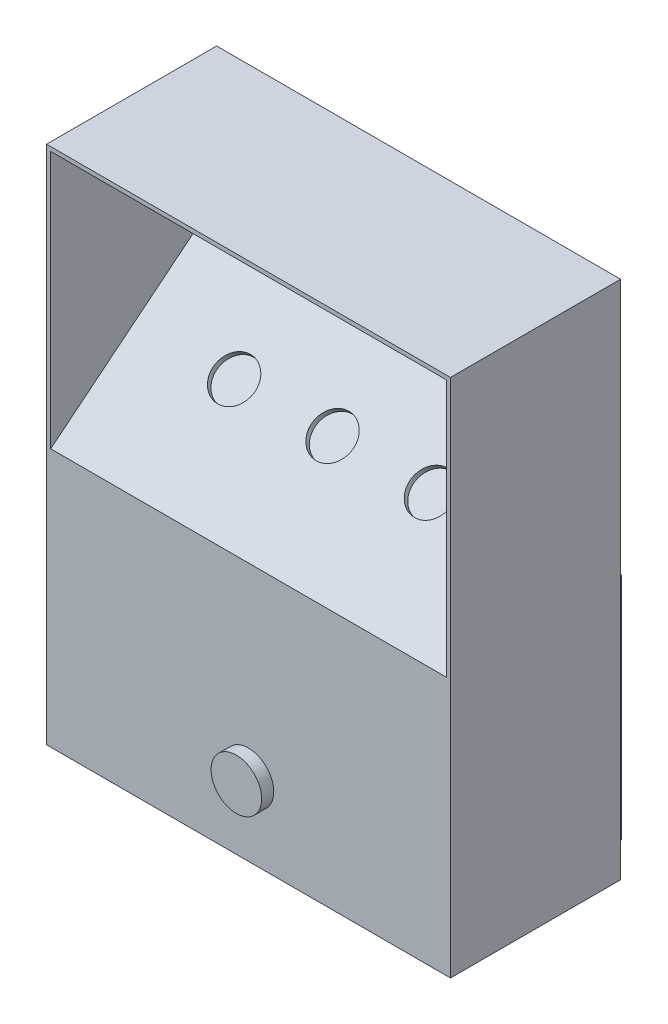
from build123d import *

# Parameters (mm, degrees)
SKETCH1_W           = 182.4736
SKETCH1_H           = 234.95
BOSS_EXTRUDE1_DEPTH = 76.835
SKETCH2_W           = 151.5618
SKETCH2_H           = 103.5558
BOSS_EXTRUDE2_DEPTH = 15.8496
CUT_EXTRUDE1_DEPTH  = 89.3572
SKETCH4_R           = 9.525
CUT_EXTRUDE2_DEPTH  = 2.54
SKETCH5_R           = 2.54
CUT_EXTRUDE3_DEPTH  = 5.08
SKETCH6_R           = 11.43
BOSS_EXTRUDE3_DEPTH = 5.469796


with BuildPart() as part:
    # Sketch1 → Boss-Extrude1 (new body)
    with BuildSketch(Plane.XY):
        with Locations((0, 117.475)):
            Rectangle(SKETCH1_W, SKETCH1_H)
    extrude(amount=BOSS_EXTRUDE1_DEPTH)

    # Sketch2 → Boss-Extrude2 (add)
    with BuildSketch(Plane(origin=(0, 0, 0), x_dir=(-1, 0, 0), z_dir=(0, 0, -1))):
        with Locations((0, 51.7779)):
            Rectangle(SKETCH2_W, SKETCH2_H)
    extrude(amount=BOSS_EXTRUDE2_DEPTH)

    # Sketch3 → Cut-Extrude1 (cut, symmetric)
    with BuildSketch(Plane(origin=(0, 0, 0), x_dir=(0, 0, -1), z_dir=(1, 0, 0))):
        Polygon((-0.9398, 233.0704), (-0.9398, 178.186093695), (-76.835, 116.727372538), (-76.835, 233.0704), align=None)
    extrude(amount=CUT_EXTRUDE1_DEPTH, both=True, mode=Mode.SUBTRACT)

    # Sketch4 → Cut-Extrude2 (cut)
    with BuildSketch(Plane(origin=(0, 108.076164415, 87.518352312), x_dir=(1, 0, 0), z_dir=(0, 0.7771459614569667, 0.6293203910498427))):
        with Locations(Location((-44.45, 62.576343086, 0), (0, 0, 270))):
            Circle(SKETCH4_R)
        with Locations(Location((44.45, 62.576343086, 0), (0, 0, 270))):
            Circle(SKETCH4_R)
        with Locations(Location((0, 62.576343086, 0), (0, 0, 270))):
            Circle(SKETCH4_R)
    extrude(amount=-CUT_EXTRUDE2_DEPTH, mode=Mode.SUBTRACT)

    # Sketch5 → Cut-Extrude3 (cut)
    with BuildSketch(Plane(origin=(0, 0, -15.8496), x_dir=(-1, 0, 0), z_dir=(0, 0, -1))):
        with Locations((57.15, 14.1224)):
            Circle(SKETCH5_R)
        with Locations((57.15, 90.3224)):
            Circle(SKETCH5_R)
        with Locations(Location((-57.15, 90.3224, 0), (0, 0, 180))):
            Circle(SKETCH5_R)
        with Locations(Location((-57.15, 14.1224, 0), (0, 0, 180))):
            Circle(SKETCH5_R)
    extrude(amount=-CUT_EXTRUDE3_DEPTH, mode=Mode.SUBTRACT)

    # Sketch6 → Boss-Extrude3 (add)
    with BuildSketch(Plane.XY.offset(76.835)):
        with Locations((-0.0238, 32.892123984)):
            Circle(SKETCH6_R)
    extrude(amount=BOSS_EXTRUDE3_DEPTH)


solid = part.part
